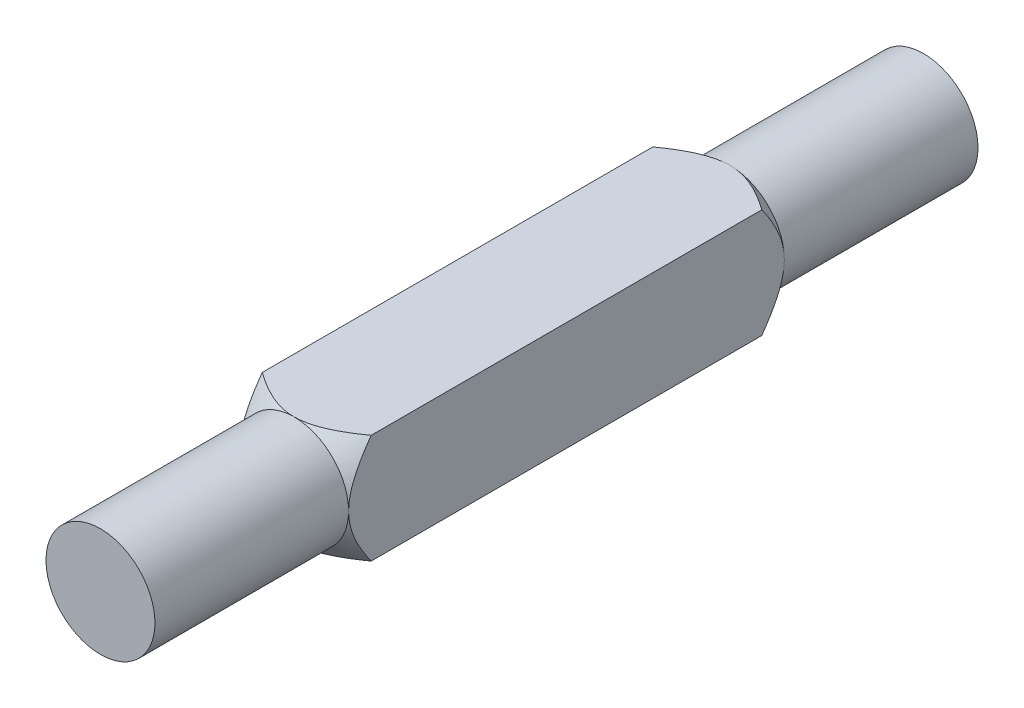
from build123d import *

# Parameters (mm, degrees)
SKETCH1_W      = 9
SKETCH1_H      = 9
EXTRUDE1_DEPTH = 34


with BuildPart() as part:
    # Sketch1 → Extrude1 (new body)
    with BuildSketch(Plane.XY):
        Rectangle(SKETCH1_W, SKETCH1_H)
    extrude1 = extrude(amount=EXTRUDE1_DEPTH)

    # Mirror19: Extrude1 across plane
    add(extrude1.mirror(Plane(origin=(-4.5, 4.5, 0), x_dir=(1, 0, 0), z_dir=(0, 0, -1))))

    # Sketch3 → Cut-Revolve1 (revolve, cut)
    with BuildSketch(Plane(origin=(0, 0, 0), x_dir=(0, 0, -1), z_dir=(1, 0, 0)), mode=Mode.PRIVATE) as cut_revolve1_sk:
        Polygon((-34, 4.5), (-18, 4.5), (-13, 9.5), (-34, 9.5), align=None)
    cut_revolve1 = revolve(cut_revolve1_sk.sketch.rotate(Axis((0, 0, 34), (0, 0, 1)), 90), axis=Axis((0, 0, 34), (0, 0, 1)), mode=Mode.SUBTRACT)

    # Mirror20: Cut-Revolve1 across plane
    add(cut_revolve1.mirror(Plane.XY), mode=Mode.SUBTRACT)


solid = part.part
